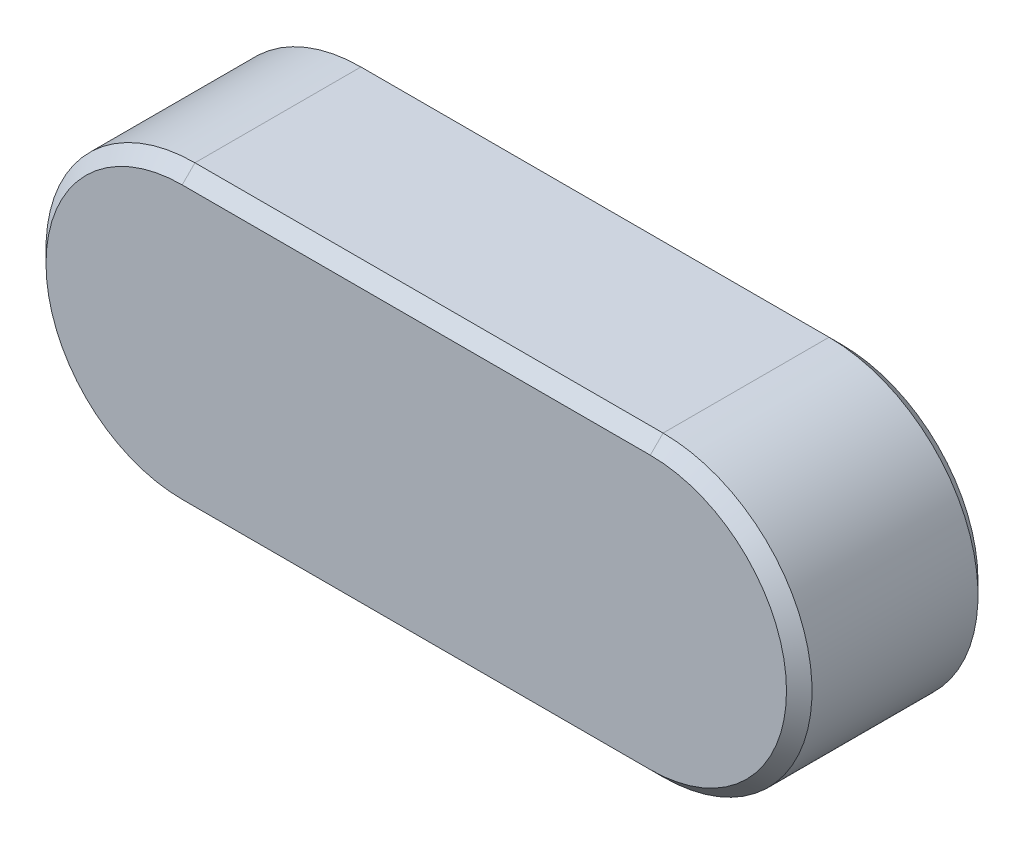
ISO-10303-21;
HEADER;
FILE_DESCRIPTION(('STEP AP214'),'2;1');
FILE_NAME('part.step','',(''),(''),'','','');
FILE_SCHEMA(('AUTOMOTIVE_DESIGN { 1 0 10303 214 1 1 1 1 }'));
ENDSEC;
DATA;
#1=APPLICATION_CONTEXT('core data for automotive mechanical design processes');
#2=APPLICATION_PROTOCOL_DEFINITION('international standard','automotive_design',2000,#1);
#3=PRODUCT_CONTEXT('',#1,'mechanical');
#4=PRODUCT('Part','Part','',(#3));
#5=PRODUCT_RELATED_PRODUCT_CATEGORY('part','',(#4));
#6=PRODUCT_DEFINITION_FORMATION('','',#4);
#7=PRODUCT_DEFINITION_CONTEXT('part definition',#1,'design');
#8=PRODUCT_DEFINITION('design','',#6,#7);
#9=PRODUCT_DEFINITION_SHAPE('','',#8);
#10=(LENGTH_UNIT() NAMED_UNIT(*) SI_UNIT(.MILLI.,.METRE.));
#11=(NAMED_UNIT(*) PLANE_ANGLE_UNIT() SI_UNIT($,.RADIAN.));
#12=(NAMED_UNIT(*) SI_UNIT($,.STERADIAN.) SOLID_ANGLE_UNIT());
#13=UNCERTAINTY_MEASURE_WITH_UNIT(LENGTH_MEASURE(1.E-05),#10,'distance_accuracy_value','');
#14=(GEOMETRIC_REPRESENTATION_CONTEXT(3) GLOBAL_UNCERTAINTY_ASSIGNED_CONTEXT((#13)) GLOBAL_UNIT_ASSIGNED_CONTEXT((#10,
#11,#12)) REPRESENTATION_CONTEXT('',''));
#15=CARTESIAN_POINT('',(0.,0.,0.));
#16=DIRECTION('',(0.,0.,1.));
#17=DIRECTION('',(1.,0.,0.));
#18=AXIS2_PLACEMENT_3D('',#15,#16,#17);
#19=CARTESIAN_POINT('',(-22.,0.,4.5));
#20=DIRECTION('',(0.,0.,-1.));
#21=DIRECTION('',(-1.,0.,0.));
#22=AXIS2_PLACEMENT_3D('',#19,#20,#21);
#23=CYLINDRICAL_SURFACE('',#22,7.);
#24=DIRECTION('',(0.,0.,-1.));
#25=VECTOR('',#24,1.);
#26=CARTESIAN_POINT('',(-22.,-7.,4.5));
#27=LINE('',#26,#25);
#28=CARTESIAN_POINT('',(-22.,-7.,3.9));
#29=VERTEX_POINT('',#28);
#30=CARTESIAN_POINT('',(-22.,-7.,-3.9));
#31=VERTEX_POINT('',#30);
#32=EDGE_CURVE('E119',#29,#31,#27,.T.);
#33=ORIENTED_EDGE('',*,*,#32,.F.);
#34=CARTESIAN_POINT('',(-22.,0.,3.9));
#35=DIRECTION('',(0.,0.,-1.));
#36=DIRECTION('',(-1.,0.,0.));
#37=AXIS2_PLACEMENT_3D('',#34,#35,#36);
#38=CIRCLE('',#37,7.);
#39=CARTESIAN_POINT('',(-22.,7.,3.9));
#40=VERTEX_POINT('',#39);
#41=EDGE_CURVE('E53',#29,#40,#38,.T.);
#42=ORIENTED_EDGE('',*,*,#41,.T.);
#43=DIRECTION('',(0.,0.,-1.));
#44=VECTOR('',#43,1.);
#45=CARTESIAN_POINT('',(-22.,7.,4.5));
#46=LINE('',#45,#44);
#47=CARTESIAN_POINT('',(-22.,7.,-3.9));
#48=VERTEX_POINT('',#47);
#49=EDGE_CURVE('E157',#40,#48,#46,.T.);
#50=ORIENTED_EDGE('',*,*,#49,.T.);
#51=CARTESIAN_POINT('',(-22.,0.,-3.9));
#52=DIRECTION('',(0.,0.,-1.));
#53=DIRECTION('',(-1.,0.,0.));
#54=AXIS2_PLACEMENT_3D('',#51,#52,#53);
#55=CIRCLE('',#54,7.);
#56=EDGE_CURVE('E107',#48,#31,#55,.F.);
#57=ORIENTED_EDGE('',*,*,#56,.T.);
#58=EDGE_LOOP('',(#33,#42,#50,#57));
#59=FACE_BOUND('',#58,.T.);
#60=ADVANCED_FACE('F30',(#59),#23,.T.);
#61=CARTESIAN_POINT('',(0.,-7.,4.5));
#62=DIRECTION('',(0.,1.,0.));
#63=DIRECTION('',(-1.,0.,0.));
#64=AXIS2_PLACEMENT_3D('',#61,#62,#63);
#65=PLANE('',#64);
#66=ORIENTED_EDGE('',*,*,#32,.T.);
#67=DIRECTION('',(1.,0.,0.));
#68=VECTOR('',#67,1.);
#69=CARTESIAN_POINT('',(0.,-7.,-3.9));
#70=LINE('',#69,#68);
#71=CARTESIAN_POINT('',(0.,-7.,-3.9));
#72=VERTEX_POINT('',#71);
#73=EDGE_CURVE('E118',#31,#72,#70,.T.);
#74=ORIENTED_EDGE('',*,*,#73,.T.);
#75=DIRECTION('',(0.,0.,-1.));
#76=VECTOR('',#75,1.);
#77=CARTESIAN_POINT('',(0.,-7.,4.5));
#78=LINE('',#77,#76);
#79=CARTESIAN_POINT('',(0.,-7.,3.9));
#80=VERTEX_POINT('',#79);
#81=EDGE_CURVE('E101',#80,#72,#78,.T.);
#82=ORIENTED_EDGE('',*,*,#81,.F.);
#83=DIRECTION('',(-1.,0.,0.));
#84=VECTOR('',#83,1.);
#85=CARTESIAN_POINT('',(0.,-7.,3.9));
#86=LINE('',#85,#84);
#87=EDGE_CURVE('E116',#80,#29,#86,.T.);
#88=ORIENTED_EDGE('',*,*,#87,.T.);
#89=EDGE_LOOP('',(#66,#74,#82,#88));
#90=FACE_BOUND('',#89,.T.);
#91=ADVANCED_FACE('F115',(#90),#65,.F.);
#92=CARTESIAN_POINT('',(0.,0.,4.5));
#93=DIRECTION('',(0.,0.,-1.));
#94=DIRECTION('',(-1.,0.,0.));
#95=AXIS2_PLACEMENT_3D('',#92,#93,#94);
#96=CYLINDRICAL_SURFACE('',#95,7.);
#97=DIRECTION('',(0.,0.,-1.));
#98=VECTOR('',#97,1.);
#99=CARTESIAN_POINT('',(0.,7.,4.5));
#100=LINE('',#99,#98);
#101=CARTESIAN_POINT('',(0.,7.,3.9));
#102=VERTEX_POINT('',#101);
#103=CARTESIAN_POINT('',(0.,7.,-3.9));
#104=VERTEX_POINT('',#103);
#105=EDGE_CURVE('E102',#102,#104,#100,.T.);
#106=ORIENTED_EDGE('',*,*,#105,.F.);
#107=CARTESIAN_POINT('',(0.,0.,3.9));
#108=DIRECTION('',(0.,0.,-1.));
#109=DIRECTION('',(-1.,0.,0.));
#110=AXIS2_PLACEMENT_3D('',#107,#108,#109);
#111=CIRCLE('',#110,7.);
#112=EDGE_CURVE('E98',#102,#80,#111,.T.);
#113=ORIENTED_EDGE('',*,*,#112,.T.);
#114=ORIENTED_EDGE('',*,*,#81,.T.);
#115=CARTESIAN_POINT('',(0.,0.,-3.9));
#116=DIRECTION('',(0.,0.,-1.));
#117=DIRECTION('',(-1.,0.,0.));
#118=AXIS2_PLACEMENT_3D('',#115,#116,#117);
#119=CIRCLE('',#118,7.);
#120=EDGE_CURVE('E108',#72,#104,#119,.F.);
#121=ORIENTED_EDGE('',*,*,#120,.T.);
#122=EDGE_LOOP('',(#106,#113,#114,#121));
#123=FACE_BOUND('',#122,.T.);
#124=ADVANCED_FACE('F100',(#123),#96,.T.);
#125=CARTESIAN_POINT('',(-22.,7.,4.5));
#126=DIRECTION('',(0.,-1.,0.));
#127=DIRECTION('',(1.,0.,0.));
#128=AXIS2_PLACEMENT_3D('',#125,#126,#127);
#129=PLANE('',#128);
#130=ORIENTED_EDGE('',*,*,#49,.F.);
#131=DIRECTION('',(1.,0.,0.));
#132=VECTOR('',#131,1.);
#133=CARTESIAN_POINT('',(-22.,7.,3.9));
#134=LINE('',#133,#132);
#135=EDGE_CURVE('E11',#40,#102,#134,.T.);
#136=ORIENTED_EDGE('',*,*,#135,.T.);
#137=ORIENTED_EDGE('',*,*,#105,.T.);
#138=DIRECTION('',(-1.,0.,0.));
#139=VECTOR('',#138,1.);
#140=CARTESIAN_POINT('',(-22.,7.,-3.9));
#141=LINE('',#140,#139);
#142=EDGE_CURVE('E39',#104,#48,#141,.T.);
#143=ORIENTED_EDGE('',*,*,#142,.T.);
#144=EDGE_LOOP('',(#130,#136,#137,#143));
#145=FACE_BOUND('',#144,.T.);
#146=ADVANCED_FACE('F207',(#145),#129,.F.);
#147=CARTESIAN_POINT('',(-22.,0.,4.5));
#148=DIRECTION('',(0.,0.,-1.));
#149=DIRECTION('',(-1.,0.,0.));
#150=AXIS2_PLACEMENT_3D('',#147,#148,#149);
#151=PLANE('',#150);
#152=CARTESIAN_POINT('',(-22.,0.,4.5));
#153=DIRECTION('',(0.,0.,-1.));
#154=DIRECTION('',(-1.,0.,0.));
#155=AXIS2_PLACEMENT_3D('',#152,#153,#154);
#156=CIRCLE('',#155,6.40000000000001);
#157=CARTESIAN_POINT('',(-22.,6.40000000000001,4.5));
#158=VERTEX_POINT('',#157);
#159=CARTESIAN_POINT('',(-22.,-6.40000000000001,4.5));
#160=VERTEX_POINT('',#159);
#161=EDGE_CURVE('E178',#158,#160,#156,.F.);
#162=ORIENTED_EDGE('',*,*,#161,.T.);
#163=DIRECTION('',(1.,0.,0.));
#164=VECTOR('',#163,1.);
#165=CARTESIAN_POINT('',(-22.,-6.40000000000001,4.5));
#166=LINE('',#165,#164);
#167=CARTESIAN_POINT('',(0.,-6.40000000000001,4.5));
#168=VERTEX_POINT('',#167);
#169=EDGE_CURVE('E181',#160,#168,#166,.T.);
#170=ORIENTED_EDGE('',*,*,#169,.T.);
#171=CARTESIAN_POINT('',(0.,0.,4.5));
#172=DIRECTION('',(0.,0.,-1.));
#173=DIRECTION('',(-1.,0.,0.));
#174=AXIS2_PLACEMENT_3D('',#171,#172,#173);
#175=CIRCLE('',#174,6.40000000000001);
#176=CARTESIAN_POINT('',(0.,6.40000000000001,4.5));
#177=VERTEX_POINT('',#176);
#178=EDGE_CURVE('E130',#168,#177,#175,.F.);
#179=ORIENTED_EDGE('',*,*,#178,.T.);
#180=DIRECTION('',(-1.,0.,0.));
#181=VECTOR('',#180,1.);
#182=CARTESIAN_POINT('',(-22.,6.40000000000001,4.5));
#183=LINE('',#182,#181);
#184=EDGE_CURVE('E176',#177,#158,#183,.T.);
#185=ORIENTED_EDGE('',*,*,#184,.T.);
#186=EDGE_LOOP('',(#162,#170,#179,#185));
#187=FACE_BOUND('',#186,.T.);
#188=ADVANCED_FACE('F210',(#187),#151,.F.);
#189=CARTESIAN_POINT('',(-22.,0.,-4.5));
#190=DIRECTION('',(0.,0.,-1.));
#191=DIRECTION('',(-1.,0.,0.));
#192=AXIS2_PLACEMENT_3D('',#189,#190,#191);
#193=PLANE('',#192);
#194=CARTESIAN_POINT('',(0.,0.,-4.5));
#195=DIRECTION('',(0.,0.,-1.));
#196=DIRECTION('',(-1.,0.,0.));
#197=AXIS2_PLACEMENT_3D('',#194,#195,#196);
#198=CIRCLE('',#197,6.4);
#199=CARTESIAN_POINT('',(0.,6.4,-4.5));
#200=VERTEX_POINT('',#199);
#201=CARTESIAN_POINT('',(0.,-6.4,-4.5));
#202=VERTEX_POINT('',#201);
#203=EDGE_CURVE('E171',#200,#202,#198,.T.);
#204=ORIENTED_EDGE('',*,*,#203,.T.);
#205=DIRECTION('',(-1.,0.,0.));
#206=VECTOR('',#205,1.);
#207=CARTESIAN_POINT('',(-22.,-6.4,-4.5));
#208=LINE('',#207,#206);
#209=CARTESIAN_POINT('',(-22.,-6.4,-4.5));
#210=VERTEX_POINT('',#209);
#211=EDGE_CURVE('E173',#202,#210,#208,.T.);
#212=ORIENTED_EDGE('',*,*,#211,.T.);
#213=CARTESIAN_POINT('',(-22.,0.,-4.5));
#214=DIRECTION('',(0.,0.,-1.));
#215=DIRECTION('',(-1.,0.,0.));
#216=AXIS2_PLACEMENT_3D('',#213,#214,#215);
#217=CIRCLE('',#216,6.4);
#218=CARTESIAN_POINT('',(-22.,6.4,-4.5));
#219=VERTEX_POINT('',#218);
#220=EDGE_CURVE('E169',#210,#219,#217,.T.);
#221=ORIENTED_EDGE('',*,*,#220,.T.);
#222=DIRECTION('',(1.,0.,0.));
#223=VECTOR('',#222,1.);
#224=CARTESIAN_POINT('',(0.,6.4,-4.5));
#225=LINE('',#224,#223);
#226=EDGE_CURVE('E167',#219,#200,#225,.T.);
#227=ORIENTED_EDGE('',*,*,#226,.T.);
#228=EDGE_LOOP('',(#204,#212,#221,#227));
#229=FACE_BOUND('',#228,.T.);
#230=ADVANCED_FACE('F211',(#229),#193,.T.);
#231=CARTESIAN_POINT('',(-22.,7.,-3.9));
#232=DIRECTION('',(0.,0.707106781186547,-0.707106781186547));
#233=DIRECTION('',(0.,0.707106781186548,0.707106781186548));
#234=AXIS2_PLACEMENT_3D('',#231,#232,#233);
#235=PLANE('',#234);
#236=DIRECTION('',(0.,0.707106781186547,0.707106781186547));
#237=VECTOR('',#236,1.);
#238=CARTESIAN_POINT('',(0.,6.4,-4.5));
#239=LINE('',#238,#237);
#240=EDGE_CURVE('E149',#200,#104,#239,.T.);
#241=ORIENTED_EDGE('',*,*,#240,.F.);
#242=ORIENTED_EDGE('',*,*,#226,.F.);
#243=DIRECTION('',(0.,-0.707106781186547,-0.707106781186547));
#244=VECTOR('',#243,1.);
#245=CARTESIAN_POINT('',(-22.,7.,-3.9));
#246=LINE('',#245,#244);
#247=EDGE_CURVE('E136',#48,#219,#246,.T.);
#248=ORIENTED_EDGE('',*,*,#247,.F.);
#249=ORIENTED_EDGE('',*,*,#142,.F.);
#250=EDGE_LOOP('',(#241,#242,#248,#249));
#251=FACE_BOUND('',#250,.T.);
#252=ADVANCED_FACE('F214',(#251),#235,.T.);
#253=CARTESIAN_POINT('',(-22.,0.,-3.9));
#254=DIRECTION('',(0.,0.,1.));
#255=DIRECTION('',(1.,0.,0.));
#256=AXIS2_PLACEMENT_3D('',#253,#254,#255);
#257=CONICAL_SURFACE('',#256,7.,0.785398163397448);
#258=ORIENTED_EDGE('',*,*,#247,.T.);
#259=ORIENTED_EDGE('',*,*,#220,.F.);
#260=DIRECTION('',(0.,0.707106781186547,-0.707106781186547));
#261=VECTOR('',#260,1.);
#262=CARTESIAN_POINT('',(-22.,-7.,-3.9));
#263=LINE('',#262,#261);
#264=EDGE_CURVE('E143',#31,#210,#263,.T.);
#265=ORIENTED_EDGE('',*,*,#264,.F.);
#266=ORIENTED_EDGE('',*,*,#56,.F.);
#267=EDGE_LOOP('',(#258,#259,#265,#266));
#268=FACE_BOUND('',#267,.T.);
#269=ADVANCED_FACE('F186',(#268),#257,.T.);
#270=CARTESIAN_POINT('',(0.,0.,-3.9));
#271=DIRECTION('',(0.,0.,1.));
#272=DIRECTION('',(1.,0.,0.));
#273=AXIS2_PLACEMENT_3D('',#270,#271,#272);
#274=CONICAL_SURFACE('',#273,7.,0.785398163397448);
#275=ORIENTED_EDGE('',*,*,#240,.T.);
#276=ORIENTED_EDGE('',*,*,#120,.F.);
#277=DIRECTION('',(0.,-0.707106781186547,0.707106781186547));
#278=VECTOR('',#277,1.);
#279=CARTESIAN_POINT('',(0.,-6.4,-4.5));
#280=LINE('',#279,#278);
#281=EDGE_CURVE('E139',#202,#72,#280,.T.);
#282=ORIENTED_EDGE('',*,*,#281,.F.);
#283=ORIENTED_EDGE('',*,*,#203,.F.);
#284=EDGE_LOOP('',(#275,#276,#282,#283));
#285=FACE_BOUND('',#284,.T.);
#286=ADVANCED_FACE('F189',(#285),#274,.T.);
#287=CARTESIAN_POINT('',(0.,-7.,-3.9));
#288=DIRECTION('',(0.,-0.707106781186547,-0.707106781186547));
#289=DIRECTION('',(0.,0.707106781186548,-0.707106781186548));
#290=AXIS2_PLACEMENT_3D('',#287,#288,#289);
#291=PLANE('',#290);
#292=ORIENTED_EDGE('',*,*,#264,.T.);
#293=ORIENTED_EDGE('',*,*,#211,.F.);
#294=ORIENTED_EDGE('',*,*,#281,.T.);
#295=ORIENTED_EDGE('',*,*,#73,.F.);
#296=EDGE_LOOP('',(#292,#293,#294,#295));
#297=FACE_BOUND('',#296,.T.);
#298=ADVANCED_FACE('F187',(#297),#291,.T.);
#299=CARTESIAN_POINT('',(-22.,6.40000000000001,4.5));
#300=DIRECTION('',(0.,-0.70710678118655,-0.707106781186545));
#301=DIRECTION('',(0.,0.707106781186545,-0.70710678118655));
#302=AXIS2_PLACEMENT_3D('',#299,#300,#301);
#303=PLANE('',#302);
#304=DIRECTION('',(0.,-0.707106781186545,0.70710678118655));
#305=VECTOR('',#304,1.);
#306=CARTESIAN_POINT('',(0.,7.,3.9));
#307=LINE('',#306,#305);
#308=EDGE_CURVE('E133',#102,#177,#307,.T.);
#309=ORIENTED_EDGE('',*,*,#308,.F.);
#310=ORIENTED_EDGE('',*,*,#135,.F.);
#311=DIRECTION('',(0.,0.707106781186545,-0.70710678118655));
#312=VECTOR('',#311,1.);
#313=CARTESIAN_POINT('',(-22.,6.40000000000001,4.5));
#314=LINE('',#313,#312);
#315=EDGE_CURVE('E34',#158,#40,#314,.T.);
#316=ORIENTED_EDGE('',*,*,#315,.F.);
#317=ORIENTED_EDGE('',*,*,#184,.F.);
#318=EDGE_LOOP('',(#309,#310,#316,#317));
#319=FACE_BOUND('',#318,.T.);
#320=ADVANCED_FACE('F32',(#319),#303,.F.);
#321=CARTESIAN_POINT('',(-22.,0.,4.5));
#322=DIRECTION('',(0.,0.,-1.));
#323=DIRECTION('',(-1.,0.,0.));
#324=AXIS2_PLACEMENT_3D('',#321,#322,#323);
#325=CONICAL_SURFACE('',#324,6.40000000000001,0.785398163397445);
#326=ORIENTED_EDGE('',*,*,#315,.T.);
#327=ORIENTED_EDGE('',*,*,#41,.F.);
#328=DIRECTION('',(0.,-0.707106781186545,-0.70710678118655));
#329=VECTOR('',#328,1.);
#330=CARTESIAN_POINT('',(-22.,-6.40000000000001,4.5));
#331=LINE('',#330,#329);
#332=EDGE_CURVE('E127',#160,#29,#331,.T.);
#333=ORIENTED_EDGE('',*,*,#332,.F.);
#334=ORIENTED_EDGE('',*,*,#161,.F.);
#335=EDGE_LOOP('',(#326,#327,#333,#334));
#336=FACE_BOUND('',#335,.T.);
#337=ADVANCED_FACE('F195',(#336),#325,.T.);
#338=CARTESIAN_POINT('',(0.,0.,4.5));
#339=DIRECTION('',(0.,0.,-1.));
#340=DIRECTION('',(-1.,0.,0.));
#341=AXIS2_PLACEMENT_3D('',#338,#339,#340);
#342=CONICAL_SURFACE('',#341,6.40000000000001,0.785398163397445);
#343=ORIENTED_EDGE('',*,*,#308,.T.);
#344=ORIENTED_EDGE('',*,*,#178,.F.);
#345=DIRECTION('',(0.,0.707106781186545,0.70710678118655));
#346=VECTOR('',#345,1.);
#347=CARTESIAN_POINT('',(0.,-7.,3.9));
#348=LINE('',#347,#346);
#349=EDGE_CURVE('E124',#80,#168,#348,.T.);
#350=ORIENTED_EDGE('',*,*,#349,.F.);
#351=ORIENTED_EDGE('',*,*,#112,.F.);
#352=EDGE_LOOP('',(#343,#344,#350,#351));
#353=FACE_BOUND('',#352,.T.);
#354=ADVANCED_FACE('F129',(#353),#342,.T.);
#355=CARTESIAN_POINT('',(-22.,-6.40000000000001,4.5));
#356=DIRECTION('',(0.,0.70710678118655,-0.707106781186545));
#357=DIRECTION('',(0.,0.707106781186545,0.70710678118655));
#358=AXIS2_PLACEMENT_3D('',#355,#356,#357);
#359=PLANE('',#358);
#360=ORIENTED_EDGE('',*,*,#332,.T.);
#361=ORIENTED_EDGE('',*,*,#87,.F.);
#362=ORIENTED_EDGE('',*,*,#349,.T.);
#363=ORIENTED_EDGE('',*,*,#169,.F.);
#364=EDGE_LOOP('',(#360,#361,#362,#363));
#365=FACE_BOUND('',#364,.T.);
#366=ADVANCED_FACE('F122',(#365),#359,.F.);
#367=CLOSED_SHELL('',(#60,#91,#124,#146,#188,#230,#252,#269,#286,#298,#320,#337,#354,#366));
#368=MANIFOLD_SOLID_BREP('B2',#367);
#369=ADVANCED_BREP_SHAPE_REPRESENTATION('',(#18,#368),#14);
#370=SHAPE_DEFINITION_REPRESENTATION(#9,#369);
ENDSEC;
END-ISO-10303-21;
